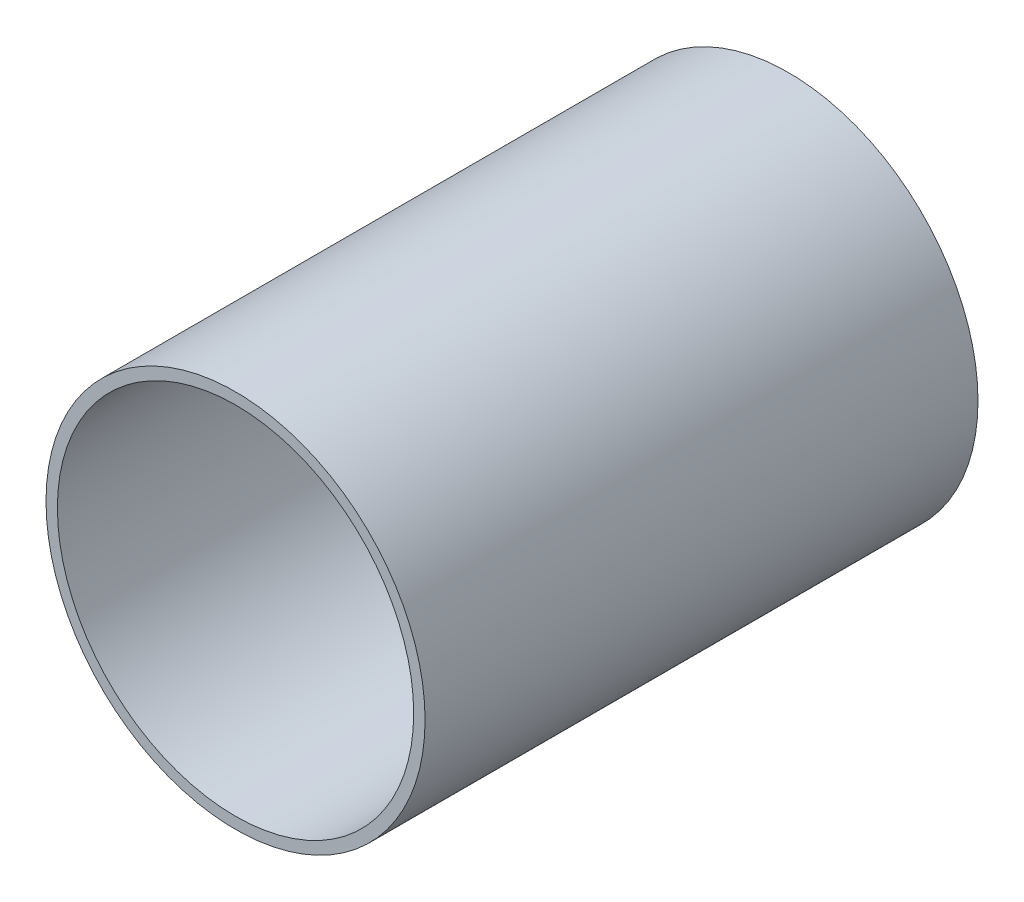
from build123d import *

# Parameters (mm, degrees)
ESQUISSE1_R          = 66.5
ESQUISSE1_R_2        = 62.5
BASE_EXTRUSION_DEPTH = 194


with BuildPart() as part:
    # Esquisse1 → Base-Extrusion (new body)
    with BuildSketch(Plane.XY):
        with Locations(Location((0, 0, 0), (0, 0, 180))):
            Circle(ESQUISSE1_R)
        with Locations(Location((0, 0, 0), (0, 0, 180))):
            Circle(ESQUISSE1_R_2, mode=Mode.SUBTRACT)
    extrude(amount=BASE_EXTRUSION_DEPTH)


solid = part.part
